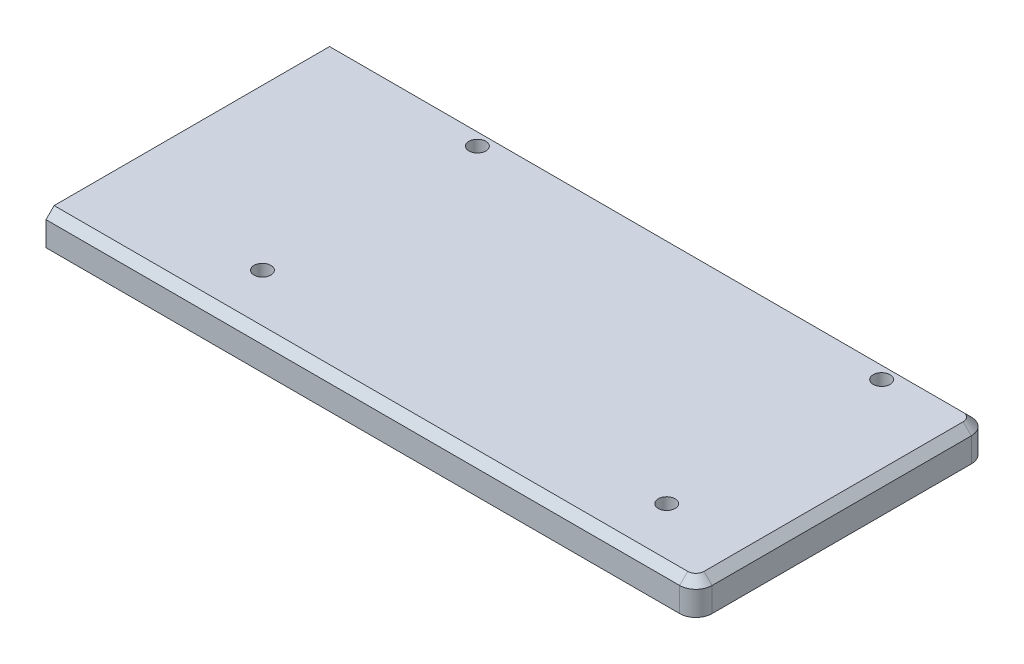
from build123d import *

# Parameters (mm, degrees)
SKETCH1_W           = 127
SKETCH1_H           = 56.9976
BOSS_EXTRUDE1_DEPTH = 6.35
FILLET1_R           = 3.175
CHAMFER1_SIZE       = 1.5875
SKETCH3_R           = 1.651
CUT_EXTRUDE1_DEPTH  = 140.348659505


with BuildPart() as part:
    # Sketch1 → Boss-Extrude1 (new body)
    with BuildSketch(Plane(origin=(0, 0, 0), x_dir=(1, 0, 0), z_dir=(0, 1, 0))):
        with Locations((63.5, 28.4988)):
            Rectangle(SKETCH1_W, SKETCH1_H)
    extrude(amount=BOSS_EXTRUDE1_DEPTH)

    # Fillet1
    fillet1_edges = [part.edges().sort_by_distance(p)[0] for p in [
        (127, 3.175, -56.9976),
        (127, 3.175, 0),
    ]]
    fillet(fillet1_edges, radius=FILLET1_R)

    # Chamfer1
    chamfer1_edges = [part.edges().sort_by_distance(p)[0] for p in [
        (61.9125, 6.35, -56.9976),
        (127, 6.35, -28.4988),
        (126.07006403, 6.35, -0.92993597),
        (126.07006403, 6.35, -56.06766403),
        (61.9125, 6.35, 0),
    ]]
    chamfer(chamfer1_edges, length=CHAMFER1_SIZE)

    # Sketch3 → Cut-Extrude1 (cut, through all)
    with BuildSketch(Plane(origin=(0, 6.35, 0), x_dir=(1, 0, 0), z_dir=(0, 1, 0))):
        with Locations(Location((110.30000038, 52.99760038, 0), (0, 0, 180))):
            Circle(SKETCH3_R)
        with Locations(Location((110.30000038, 52.99760038, 0), (0, 0, 180))):
            Circle(SKETCH3_R)
        with Locations(Location((110.30000038, 10.99760056, 0), (0, 0, 180))):
            Circle(SKETCH3_R)
        with Locations(Location((110.30000038, 10.99760056, 0), (0, 0, 180))):
            Circle(SKETCH3_R)
        with Locations(Location((31.3000009, 10.99760056, 0), (0, 0, 180))):
            Circle(SKETCH3_R)
        with Locations(Location((31.3000009, 10.99760056, 0), (0, 0, 180))):
            Circle(SKETCH3_R)
        with Locations(Location((31.3000009, 52.99760038, 0), (0, 0, 180))):
            Circle(SKETCH3_R)
        with Locations(Location((31.3000009, 52.99760038, 0), (0, 0, 180))):
            Circle(SKETCH3_R)
    extrude(amount=-CUT_EXTRUDE1_DEPTH, mode=Mode.SUBTRACT)


solid = part.part
